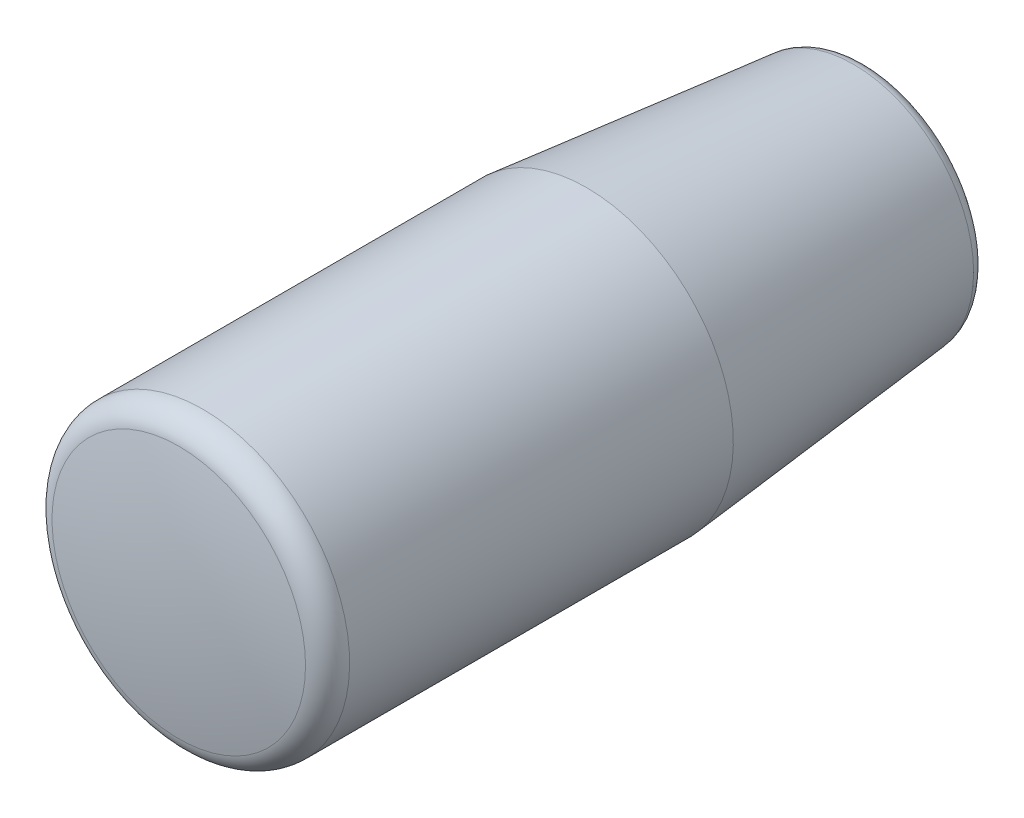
ISO-10303-21;
HEADER;
FILE_DESCRIPTION(('STEP AP214'),'2;1');
FILE_NAME('part.step','',(''),(''),'','','');
FILE_SCHEMA(('AUTOMOTIVE_DESIGN { 1 0 10303 214 1 1 1 1 }'));
ENDSEC;
DATA;
#1=APPLICATION_CONTEXT('core data for automotive mechanical design processes');
#2=APPLICATION_PROTOCOL_DEFINITION('international standard','automotive_design',2000,#1);
#3=PRODUCT_CONTEXT('',#1,'mechanical');
#4=PRODUCT('Part','Part','',(#3));
#5=PRODUCT_RELATED_PRODUCT_CATEGORY('part','',(#4));
#6=PRODUCT_DEFINITION_FORMATION('','',#4);
#7=PRODUCT_DEFINITION_CONTEXT('part definition',#1,'design');
#8=PRODUCT_DEFINITION('design','',#6,#7);
#9=PRODUCT_DEFINITION_SHAPE('','',#8);
#10=(LENGTH_UNIT() NAMED_UNIT(*) SI_UNIT(.MILLI.,.METRE.));
#11=(NAMED_UNIT(*) PLANE_ANGLE_UNIT() SI_UNIT($,.RADIAN.));
#12=(NAMED_UNIT(*) SI_UNIT($,.STERADIAN.) SOLID_ANGLE_UNIT());
#13=UNCERTAINTY_MEASURE_WITH_UNIT(LENGTH_MEASURE(1.E-05),#10,'distance_accuracy_value','');
#14=(GEOMETRIC_REPRESENTATION_CONTEXT(3) GLOBAL_UNCERTAINTY_ASSIGNED_CONTEXT((#13)) GLOBAL_UNIT_ASSIGNED_CONTEXT((#10,
#11,#12)) REPRESENTATION_CONTEXT('',''));
#15=CARTESIAN_POINT('',(0.,0.,0.));
#16=DIRECTION('',(0.,0.,1.));
#17=DIRECTION('',(1.,0.,0.));
#18=AXIS2_PLACEMENT_3D('',#15,#16,#17);
#19=CARTESIAN_POINT('',(0.,0.,0.));
#20=DIRECTION('',(0.,0.,-1.));
#21=DIRECTION('',(1.,0.,0.));
#22=AXIS2_PLACEMENT_3D('',#19,#20,#21);
#23=SPHERICAL_SURFACE('',#22,50.);
#24=CARTESIAN_POINT('',(0.,0.,49.1709571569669));
#25=DIRECTION('',(0.,0.,-1.));
#26=DIRECTION('',(0.,1.,0.));
#27=AXIS2_PLACEMENT_3D('',#24,#25,#26);
#28=CIRCLE('',#27,9.06735751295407);
#29=CARTESIAN_POINT('',(0.,9.06735751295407,49.1709571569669));
#30=VERTEX_POINT('',#29);
#31=EDGE_CURVE('E31',#30,#30,#28,.T.);
#32=ORIENTED_EDGE('',*,*,#31,.F.);
#33=EDGE_LOOP('',(#32));
#34=FACE_BOUND('',#33,.T.);
#35=ADVANCED_FACE('F12',(#34),#23,.T.);
#36=CARTESIAN_POINT('',(0.,0.,0.));
#37=DIRECTION('',(0.,0.,-1.));
#38=DIRECTION('',(0.,1.,0.));
#39=AXIS2_PLACEMENT_3D('',#36,#37,#38);
#40=PLANE('',#39);
#41=CARTESIAN_POINT('',(0.,0.,0.));
#42=DIRECTION('',(0.,0.,-1.));
#43=DIRECTION('',(0.,1.,0.));
#44=AXIS2_PLACEMENT_3D('',#41,#42,#43);
#45=CIRCLE('',#44,3.25);
#46=CARTESIAN_POINT('',(0.,3.25,0.));
#47=VERTEX_POINT('',#46);
#48=EDGE_CURVE('E37',#47,#47,#45,.T.);
#49=ORIENTED_EDGE('',*,*,#48,.F.);
#50=EDGE_LOOP('',(#49));
#51=FACE_BOUND('',#50,.T.);
#52=CARTESIAN_POINT('',(0.,0.,0.));
#53=DIRECTION('',(0.,0.,-1.));
#54=DIRECTION('',(0.,1.,0.));
#55=AXIS2_PLACEMENT_3D('',#52,#53,#54);
#56=CIRCLE('',#55,7.59501243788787);
#57=CARTESIAN_POINT('',(0.,7.59501243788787,0.));
#58=VERTEX_POINT('',#57);
#59=EDGE_CURVE('E8',#58,#58,#56,.T.);
#60=ORIENTED_EDGE('',*,*,#59,.T.);
#61=EDGE_LOOP('',(#60));
#62=FACE_BOUND('',#61,.T.);
#63=ADVANCED_FACE('F62',(#51,#62),#40,.T.);
#64=CARTESIAN_POINT('',(0.,0.,1.));
#65=DIRECTION('',(0.,0.,-1.));
#66=DIRECTION('',(0.,1.,0.));
#67=AXIS2_PLACEMENT_3D('',#64,#65,#66);
#68=TOROIDAL_SURFACE('',#67,7.59501243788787,1.);
#69=CARTESIAN_POINT('',(0.,0.,0.900496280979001));
#70=DIRECTION('',(0.,0.,-1.));
#71=DIRECTION('',(0.,1.,0.));
#72=AXIS2_PLACEMENT_3D('',#69,#70,#71);
#73=CIRCLE('',#72,8.59004962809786);
#74=CARTESIAN_POINT('',(0.,8.59004962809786,0.900496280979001));
#75=VERTEX_POINT('',#74);
#76=EDGE_CURVE('E18',#75,#75,#73,.T.);
#77=ORIENTED_EDGE('',*,*,#76,.T.);
#78=EDGE_LOOP('',(#77));
#79=FACE_BOUND('',#78,.T.);
#80=ORIENTED_EDGE('',*,*,#59,.F.);
#81=EDGE_LOOP('',(#80));
#82=FACE_BOUND('',#81,.T.);
#83=ADVANCED_FACE('F64',(#79,#82),#68,.T.);
#84=CARTESIAN_POINT('',(0.,0.,0.900496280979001));
#85=DIRECTION('',(0.,0.,1.));
#86=DIRECTION('',(0.,-1.,0.));
#87=AXIS2_PLACEMENT_3D('',#84,#85,#86);
#88=CONICAL_SURFACE('',#87,8.59004962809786,0.0996686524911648);
#89=CARTESIAN_POINT('',(0.,0.,20.));
#90=DIRECTION('',(0.,0.,-1.));
#91=DIRECTION('',(0.,1.,0.));
#92=AXIS2_PLACEMENT_3D('',#89,#90,#91);
#93=CIRCLE('',#92,10.5);
#94=CARTESIAN_POINT('',(0.,10.5,20.));
#95=VERTEX_POINT('',#94);
#96=EDGE_CURVE('E22',#95,#95,#93,.T.);
#97=ORIENTED_EDGE('',*,*,#96,.T.);
#98=EDGE_LOOP('',(#97));
#99=FACE_BOUND('',#98,.T.);
#100=ORIENTED_EDGE('',*,*,#76,.F.);
#101=EDGE_LOOP('',(#100));
#102=FACE_BOUND('',#101,.T.);
#103=ADVANCED_FACE('F71',(#99,#102),#88,.T.);
#104=CARTESIAN_POINT('',(0.,0.,0.));
#105=DIRECTION('',(0.,0.,-1.));
#106=DIRECTION('',(0.,1.,0.));
#107=AXIS2_PLACEMENT_3D('',#104,#105,#106);
#108=CYLINDRICAL_SURFACE('',#107,10.5);
#109=CARTESIAN_POINT('',(0.,0.,47.4499736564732));
#110=DIRECTION('',(0.,0.,-1.));
#111=DIRECTION('',(0.,1.,0.));
#112=AXIS2_PLACEMENT_3D('',#109,#110,#111);
#113=CIRCLE('',#112,10.5);
#114=CARTESIAN_POINT('',(0.,10.5,47.4499736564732));
#115=VERTEX_POINT('',#114);
#116=EDGE_CURVE('E26',#115,#115,#113,.T.);
#117=ORIENTED_EDGE('',*,*,#116,.T.);
#118=EDGE_LOOP('',(#117));
#119=FACE_BOUND('',#118,.T.);
#120=ORIENTED_EDGE('',*,*,#96,.F.);
#121=EDGE_LOOP('',(#120));
#122=FACE_BOUND('',#121,.T.);
#123=ADVANCED_FACE('F77',(#119,#122),#108,.T.);
#124=CARTESIAN_POINT('',(0.,0.,47.4499736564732));
#125=DIRECTION('',(0.,0.,-1.));
#126=DIRECTION('',(0.,1.,0.));
#127=AXIS2_PLACEMENT_3D('',#124,#125,#126);
#128=TOROIDAL_SURFACE('',#127,8.75,1.75000000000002);
#129=ORIENTED_EDGE('',*,*,#31,.T.);
#130=EDGE_LOOP('',(#129));
#131=FACE_BOUND('',#130,.T.);
#132=ORIENTED_EDGE('',*,*,#116,.F.);
#133=EDGE_LOOP('',(#132));
#134=FACE_BOUND('',#133,.T.);
#135=ADVANCED_FACE('F81',(#131,#134),#128,.T.);
#136=CARTESIAN_POINT('',(0.,0.,0.));
#137=DIRECTION('',(0.,0.,-1.));
#138=DIRECTION('',(0.,1.,0.));
#139=AXIS2_PLACEMENT_3D('',#136,#137,#138);
#140=CYLINDRICAL_SURFACE('',#139,3.);
#141=CARTESIAN_POINT('',(0.,0.,25.));
#142=DIRECTION('',(0.,0.,-1.));
#143=DIRECTION('',(0.,1.,0.));
#144=AXIS2_PLACEMENT_3D('',#141,#142,#143);
#145=CIRCLE('',#144,3.);
#146=CARTESIAN_POINT('',(0.,3.,25.));
#147=VERTEX_POINT('',#146);
#148=EDGE_CURVE('E34',#147,#147,#145,.T.);
#149=ORIENTED_EDGE('',*,*,#148,.F.);
#150=EDGE_LOOP('',(#149));
#151=FACE_BOUND('',#150,.T.);
#152=CARTESIAN_POINT('',(0.,0.,3.5));
#153=DIRECTION('',(0.,0.,-1.));
#154=DIRECTION('',(0.,1.,0.));
#155=AXIS2_PLACEMENT_3D('',#152,#153,#154);
#156=CIRCLE('',#155,3.);
#157=CARTESIAN_POINT('',(0.,3.,3.5));
#158=VERTEX_POINT('',#157);
#159=EDGE_CURVE('E43',#158,#158,#156,.T.);
#160=ORIENTED_EDGE('',*,*,#159,.T.);
#161=EDGE_LOOP('',(#160));
#162=FACE_BOUND('',#161,.T.);
#163=ADVANCED_FACE('F47',(#151,#162),#140,.F.);
#164=CARTESIAN_POINT('',(0.,3.,25.));
#165=DIRECTION('',(0.,0.,1.));
#166=DIRECTION('',(0.,-1.,0.));
#167=AXIS2_PLACEMENT_3D('',#164,#165,#166);
#168=PLANE('',#167);
#169=ORIENTED_EDGE('',*,*,#148,.T.);
#170=EDGE_LOOP('',(#169));
#171=FACE_BOUND('',#170,.T.);
#172=ADVANCED_FACE('F58',(#171),#168,.F.);
#173=CARTESIAN_POINT('',(0.,0.,0.));
#174=DIRECTION('',(0.,0.,-1.));
#175=DIRECTION('',(0.,1.,0.));
#176=AXIS2_PLACEMENT_3D('',#173,#174,#175);
#177=CYLINDRICAL_SURFACE('',#176,3.25);
#178=CARTESIAN_POINT('',(0.,0.,3.5));
#179=DIRECTION('',(0.,0.,-1.));
#180=DIRECTION('',(0.,1.,0.));
#181=AXIS2_PLACEMENT_3D('',#178,#179,#180);
#182=CIRCLE('',#181,3.25);
#183=CARTESIAN_POINT('',(0.,3.25,3.5));
#184=VERTEX_POINT('',#183);
#185=EDGE_CURVE('E40',#184,#184,#182,.T.);
#186=ORIENTED_EDGE('',*,*,#185,.F.);
#187=EDGE_LOOP('',(#186));
#188=FACE_BOUND('',#187,.T.);
#189=ORIENTED_EDGE('',*,*,#48,.T.);
#190=EDGE_LOOP('',(#189));
#191=FACE_BOUND('',#190,.T.);
#192=ADVANCED_FACE('F52',(#188,#191),#177,.F.);
#193=CARTESIAN_POINT('',(0.,3.25,3.5));
#194=DIRECTION('',(0.,0.,1.));
#195=DIRECTION('',(0.,-1.,0.));
#196=AXIS2_PLACEMENT_3D('',#193,#194,#195);
#197=PLANE('',#196);
#198=ORIENTED_EDGE('',*,*,#159,.F.);
#199=EDGE_LOOP('',(#198));
#200=FACE_BOUND('',#199,.T.);
#201=ORIENTED_EDGE('',*,*,#185,.T.);
#202=EDGE_LOOP('',(#201));
#203=FACE_BOUND('',#202,.T.);
#204=ADVANCED_FACE('F49',(#200,#203),#197,.F.);
#205=CLOSED_SHELL('',(#35,#63,#83,#103,#123,#135,#163,#172,#192,#204));
#206=MANIFOLD_SOLID_BREP('B1',#205);
#207=ADVANCED_BREP_SHAPE_REPRESENTATION('',(#18,#206),#14);
#208=SHAPE_DEFINITION_REPRESENTATION(#9,#207);
ENDSEC;
END-ISO-10303-21;
